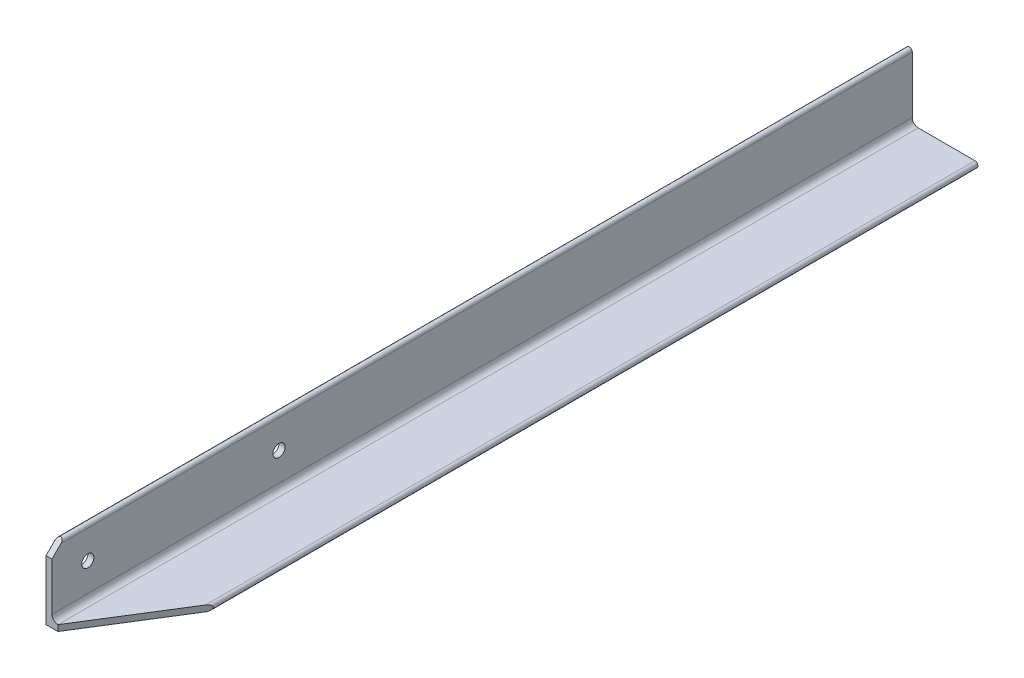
from build123d import *

# Parameters (mm, degrees)
BOSS_EXTRUDE1_DEPTH = 228.6
SKETCH2_R           = 3.2385
CUT_EXTRUDE1_DEPTH  = 235.370061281
CUT_EXTRUDE2_DEPTH  = 235.864173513


with BuildPart() as part:
    # Sketch1 → Boss-Extrude1 (new, symmetric)
    with BuildSketch(Plane.XY):
        with BuildLine():
            Line((0, 0), (0, 36.5125))
            ThreePointArc((0, 36.5125), (1.5875, 38.1), (3.175, 36.5125))
            Line((3.175, 36.5125), (3.175, 6.35))
            ThreePointArc((3.175, 6.35), (4.10493597, 4.10493597), (6.35, 3.175))
            Line((6.35, 3.175), (36.5125, 3.175))
            ThreePointArc((36.5125, 3.175), (38.1, 1.5875), (36.5125, 0))
            Line((36.5125, 0), (0, 0))
        make_face()
    extrude(amount=BOSS_EXTRUDE1_DEPTH, both=True)

    # Sketch2 → Cut-Extrude1 (cut, through all)
    with BuildSketch(Plane(origin=(3.175, 0, 0), x_dir=(0, 0, -1), z_dir=(1, 0, 0))):
        with Locations((-209.55, 21.43125)):
            Circle(SKETCH2_R)
        with Locations((-107.95, 21.43125)):
            Circle(SKETCH2_R)
        Polygon((-228.6, 31.75), (-222.25, 38.1), (-228.6, 38.1), align=None)
    extrude(amount=-CUT_EXTRUDE1_DEPTH, mode=Mode.SUBTRACT)

    # Sketch3 → Cut-Extrude2 (cut, through all)
    with BuildSketch(Plane(origin=(0, 0, 0), x_dir=(-1, 0, 0), z_dir=(0, -1, 0))):
        Polygon((-38.1, -228.6), (-38.1, -177.8), (-6.35, -228.6), align=None)
    extrude(amount=-CUT_EXTRUDE2_DEPTH, mode=Mode.SUBTRACT)


solid = part.part
